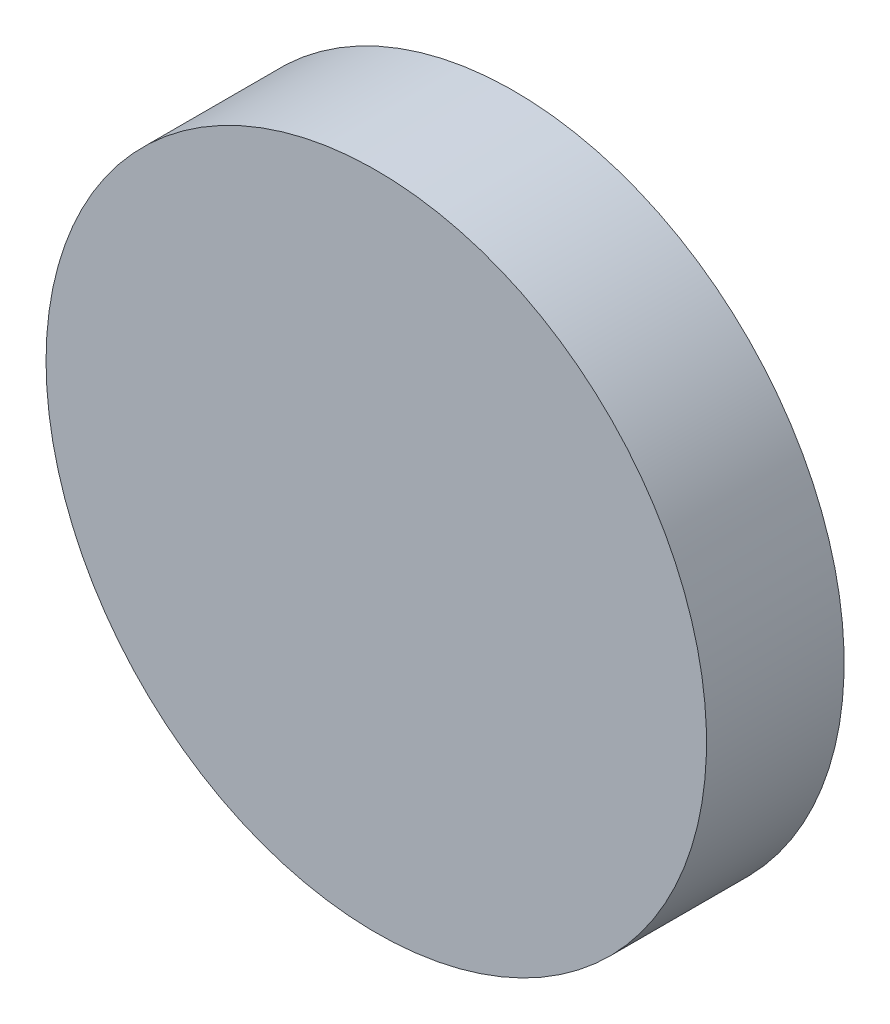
from build123d import *

# Parameters (mm, degrees)
SKETCH1_R           = 22.86
BOSS_EXTRUDE1_DEPTH = 9.525


with BuildPart() as part:
    # Sketch1 → Boss-Extrude1 (new body)
    with BuildSketch(Plane.XY):
        with Locations(Location((0, 0, 0), (0, 0, 180))):
            Circle(SKETCH1_R)
    extrude(amount=BOSS_EXTRUDE1_DEPTH)


solid = part.part
